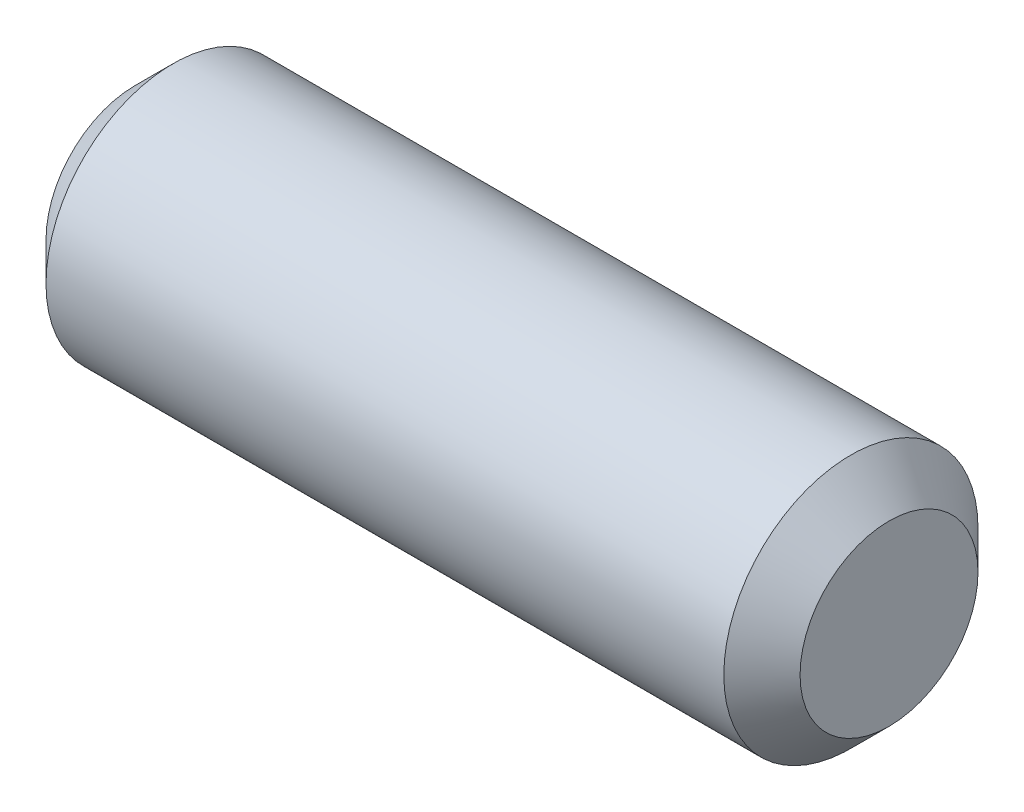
ISO-10303-21;
HEADER;
FILE_DESCRIPTION(('STEP AP214'),'2;1');
FILE_NAME('part.step','',(''),(''),'','','');
FILE_SCHEMA(('AUTOMOTIVE_DESIGN { 1 0 10303 214 1 1 1 1 }'));
ENDSEC;
DATA;
#1=APPLICATION_CONTEXT('core data for automotive mechanical design processes');
#2=APPLICATION_PROTOCOL_DEFINITION('international standard','automotive_design',2000,#1);
#3=PRODUCT_CONTEXT('',#1,'mechanical');
#4=PRODUCT('Part','Part','',(#3));
#5=PRODUCT_RELATED_PRODUCT_CATEGORY('part','',(#4));
#6=PRODUCT_DEFINITION_FORMATION('','',#4);
#7=PRODUCT_DEFINITION_CONTEXT('part definition',#1,'design');
#8=PRODUCT_DEFINITION('design','',#6,#7);
#9=PRODUCT_DEFINITION_SHAPE('','',#8);
#10=(LENGTH_UNIT() NAMED_UNIT(*) SI_UNIT(.MILLI.,.METRE.));
#11=(NAMED_UNIT(*) PLANE_ANGLE_UNIT() SI_UNIT($,.RADIAN.));
#12=(NAMED_UNIT(*) SI_UNIT($,.STERADIAN.) SOLID_ANGLE_UNIT());
#13=UNCERTAINTY_MEASURE_WITH_UNIT(LENGTH_MEASURE(1.E-05),#10,'distance_accuracy_value','');
#14=(GEOMETRIC_REPRESENTATION_CONTEXT(3) GLOBAL_UNCERTAINTY_ASSIGNED_CONTEXT((#13)) GLOBAL_UNIT_ASSIGNED_CONTEXT((#10,
#11,#12)) REPRESENTATION_CONTEXT('',''));
#15=CARTESIAN_POINT('',(0.,0.,0.));
#16=DIRECTION('',(0.,0.,1.));
#17=DIRECTION('',(1.,0.,0.));
#18=AXIS2_PLACEMENT_3D('',#15,#16,#17);
#19=CARTESIAN_POINT('',(-8.90000000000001,0.,0.));
#20=DIRECTION('',(1.,0.,0.));
#21=DIRECTION('',(0.,0.,-1.));
#22=AXIS2_PLACEMENT_3D('',#19,#20,#21);
#23=PLANE('',#22);
#24=CARTESIAN_POINT('',(-8.90000000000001,0.,0.));
#25=DIRECTION('',(-1.,0.,0.));
#26=DIRECTION('',(0.,0.,1.));
#27=AXIS2_PLACEMENT_3D('',#24,#25,#26);
#28=CIRCLE('',#27,2.09999999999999);
#29=CARTESIAN_POINT('',(-8.90000000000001,0.,2.09999999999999));
#30=VERTEX_POINT('',#29);
#31=EDGE_CURVE('E10',#30,#30,#28,.T.);
#32=ORIENTED_EDGE('',*,*,#31,.T.);
#33=EDGE_LOOP('',(#32));
#34=FACE_BOUND('',#33,.T.);
#35=ADVANCED_FACE('F33',(#34),#23,.F.);
#36=CARTESIAN_POINT('',(-8.00000000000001,0.,0.));
#37=DIRECTION('',(1.,0.,0.));
#38=DIRECTION('',(0.,0.,-1.));
#39=AXIS2_PLACEMENT_3D('',#36,#37,#38);
#40=CONICAL_SURFACE('',#39,3.,0.785398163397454);
#41=ORIENTED_EDGE('',*,*,#31,.F.);
#42=EDGE_LOOP('',(#41));
#43=FACE_BOUND('',#42,.T.);
#44=CARTESIAN_POINT('',(-8.00000000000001,0.,0.));
#45=DIRECTION('',(-1.,0.,0.));
#46=DIRECTION('',(0.,0.,1.));
#47=AXIS2_PLACEMENT_3D('',#44,#45,#46);
#48=CIRCLE('',#47,3.);
#49=CARTESIAN_POINT('',(-8.00000000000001,0.,3.));
#50=VERTEX_POINT('',#49);
#51=EDGE_CURVE('E39',#50,#50,#48,.T.);
#52=ORIENTED_EDGE('',*,*,#51,.T.);
#53=EDGE_LOOP('',(#52));
#54=FACE_BOUND('',#53,.T.);
#55=ADVANCED_FACE('F65',(#43,#54),#40,.T.);
#56=CARTESIAN_POINT('',(-15.4571342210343,0.,0.));
#57=DIRECTION('',(-1.,0.,0.));
#58=DIRECTION('',(0.,0.,1.));
#59=AXIS2_PLACEMENT_3D('',#56,#57,#58);
#60=CYLINDRICAL_SURFACE('',#59,3.);
#61=ORIENTED_EDGE('',*,*,#51,.F.);
#62=EDGE_LOOP('',(#61));
#63=FACE_BOUND('',#62,.T.);
#64=CARTESIAN_POINT('',(7.99999999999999,0.,0.));
#65=DIRECTION('',(-1.,0.,0.));
#66=DIRECTION('',(0.,0.,1.));
#67=AXIS2_PLACEMENT_3D('',#64,#65,#66);
#68=CIRCLE('',#67,3.);
#69=CARTESIAN_POINT('',(7.99999999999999,0.,3.));
#70=VERTEX_POINT('',#69);
#71=EDGE_CURVE('E43',#70,#70,#68,.T.);
#72=ORIENTED_EDGE('',*,*,#71,.T.);
#73=EDGE_LOOP('',(#72));
#74=FACE_BOUND('',#73,.T.);
#75=ADVANCED_FACE('F61',(#63,#74),#60,.T.);
#76=CARTESIAN_POINT('',(8.9,0.,0.));
#77=DIRECTION('',(-1.,0.,0.));
#78=DIRECTION('',(0.,0.,1.));
#79=AXIS2_PLACEMENT_3D('',#76,#77,#78);
#80=CONICAL_SURFACE('',#79,2.1,0.785398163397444);
#81=ORIENTED_EDGE('',*,*,#71,.F.);
#82=EDGE_LOOP('',(#81));
#83=FACE_BOUND('',#82,.T.);
#84=CARTESIAN_POINT('',(8.9,0.,0.));
#85=DIRECTION('',(-1.,0.,0.));
#86=DIRECTION('',(0.,0.,1.));
#87=AXIS2_PLACEMENT_3D('',#84,#85,#86);
#88=CIRCLE('',#87,2.1);
#89=CARTESIAN_POINT('',(8.9,0.,2.1));
#90=VERTEX_POINT('',#89);
#91=EDGE_CURVE('E47',#90,#90,#88,.T.);
#92=ORIENTED_EDGE('',*,*,#91,.T.);
#93=EDGE_LOOP('',(#92));
#94=FACE_BOUND('',#93,.T.);
#95=ADVANCED_FACE('F53',(#83,#94),#80,.T.);
#96=CARTESIAN_POINT('',(8.90000000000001,2.1,0.));
#97=DIRECTION('',(-1.,0.,0.));
#98=DIRECTION('',(0.,0.,1.));
#99=AXIS2_PLACEMENT_3D('',#96,#97,#98);
#100=PLANE('',#99);
#101=ORIENTED_EDGE('',*,*,#91,.F.);
#102=EDGE_LOOP('',(#101));
#103=FACE_BOUND('',#102,.T.);
#104=ADVANCED_FACE('F55',(#103),#100,.F.);
#105=CLOSED_SHELL('',(#35,#55,#75,#95,#104));
#106=MANIFOLD_SOLID_BREP('B2',#105);
#107=ADVANCED_BREP_SHAPE_REPRESENTATION('',(#18,#106),#14);
#108=SHAPE_DEFINITION_REPRESENTATION(#9,#107);
ENDSEC;
END-ISO-10303-21;
